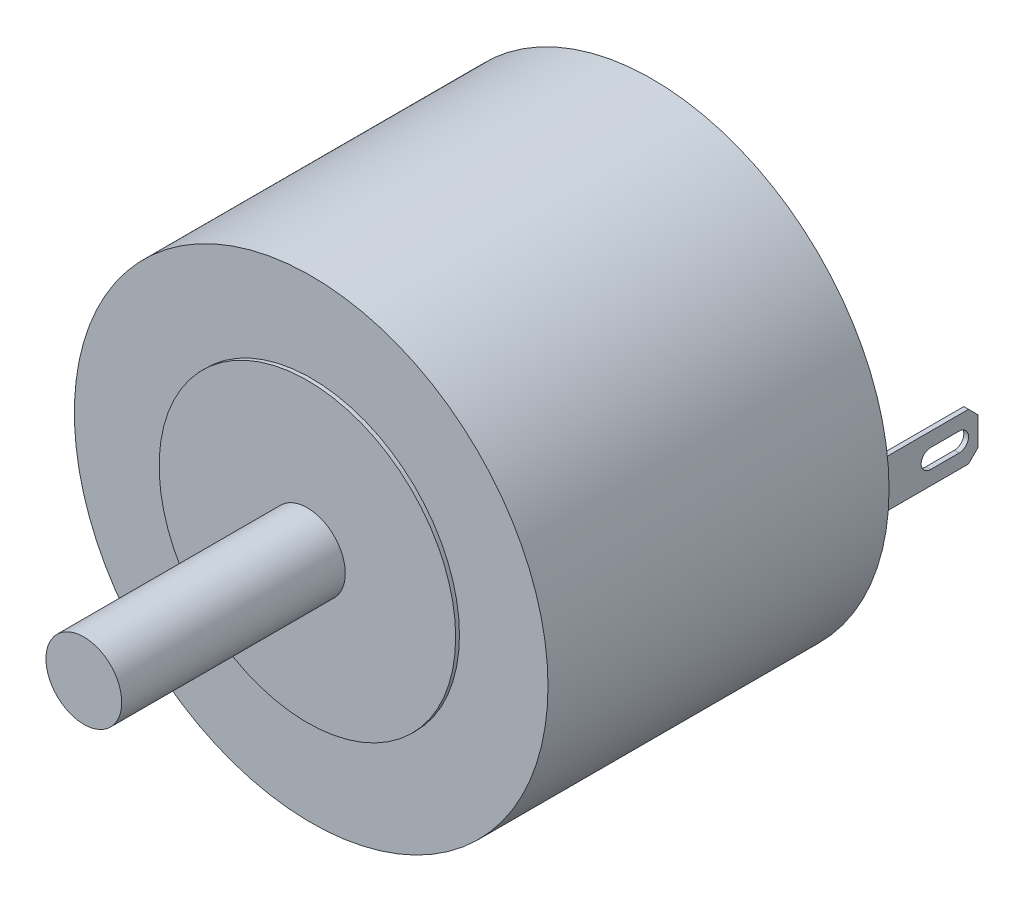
ISO-10303-21;
HEADER;
FILE_DESCRIPTION(('STEP AP214'),'2;1');
FILE_NAME('part.step','',(''),(''),'','','');
FILE_SCHEMA(('AUTOMOTIVE_DESIGN { 1 0 10303 214 1 1 1 1 }'));
ENDSEC;
DATA;
#1=APPLICATION_CONTEXT('core data for automotive mechanical design processes');
#2=APPLICATION_PROTOCOL_DEFINITION('international standard','automotive_design',2000,#1);
#3=PRODUCT_CONTEXT('',#1,'mechanical');
#4=PRODUCT('Part','Part','',(#3));
#5=PRODUCT_RELATED_PRODUCT_CATEGORY('part','',(#4));
#6=PRODUCT_DEFINITION_FORMATION('','',#4);
#7=PRODUCT_DEFINITION_CONTEXT('part definition',#1,'design');
#8=PRODUCT_DEFINITION('design','',#6,#7);
#9=PRODUCT_DEFINITION_SHAPE('','',#8);
#10=(LENGTH_UNIT() NAMED_UNIT(*) SI_UNIT(.MILLI.,.METRE.));
#11=(NAMED_UNIT(*) PLANE_ANGLE_UNIT() SI_UNIT($,.RADIAN.));
#12=(NAMED_UNIT(*) SI_UNIT($,.STERADIAN.) SOLID_ANGLE_UNIT());
#13=UNCERTAINTY_MEASURE_WITH_UNIT(LENGTH_MEASURE(1.E-05),#10,'distance_accuracy_value','');
#14=(GEOMETRIC_REPRESENTATION_CONTEXT(3) GLOBAL_UNCERTAINTY_ASSIGNED_CONTEXT((#13)) GLOBAL_UNIT_ASSIGNED_CONTEXT((#10,
#11,#12)) REPRESENTATION_CONTEXT('',''));
#15=CARTESIAN_POINT('',(0.,0.,0.));
#16=DIRECTION('',(0.,0.,1.));
#17=DIRECTION('',(1.,0.,0.));
#18=AXIS2_PLACEMENT_3D('',#15,#16,#17);
#19=CARTESIAN_POINT('',(-11.944768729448,-1.25000000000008,-23.));
#20=DIRECTION('',(0.,1.,0.));
#21=DIRECTION('',(-1.,0.,0.));
#22=AXIS2_PLACEMENT_3D('',#19,#20,#21);
#23=PLANE('',#22);
#24=DIRECTION('',(0.,0.,1.));
#25=VECTOR('',#24,1.);
#26=CARTESIAN_POINT('',(-12.194768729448,-1.25000000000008,-23.));
#27=LINE('',#26,#25);
#28=CARTESIAN_POINT('',(-12.194768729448,-1.25000000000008,-22.5));
#29=VERTEX_POINT('',#28);
#30=CARTESIAN_POINT('',(-12.194768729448,-1.25000000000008,-18.));
#31=VERTEX_POINT('',#30);
#32=EDGE_CURVE('E145',#29,#31,#27,.T.);
#33=ORIENTED_EDGE('',*,*,#32,.F.);
#34=DIRECTION('',(1.,0.,0.));
#35=VECTOR('',#34,1.);
#36=CARTESIAN_POINT('',(-11.944768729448,-1.25000000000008,-22.5));
#37=LINE('',#36,#35);
#38=CARTESIAN_POINT('',(-11.944768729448,-1.25000000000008,-22.5));
#39=VERTEX_POINT('',#38);
#40=EDGE_CURVE('E185',#29,#39,#37,.T.);
#41=ORIENTED_EDGE('',*,*,#40,.T.);
#42=DIRECTION('',(0.,0.,1.));
#43=VECTOR('',#42,1.);
#44=CARTESIAN_POINT('',(-11.944768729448,-1.25000000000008,-23.));
#45=LINE('',#44,#43);
#46=CARTESIAN_POINT('',(-11.944768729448,-1.25000000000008,-18.));
#47=VERTEX_POINT('',#46);
#48=EDGE_CURVE('E155',#39,#47,#45,.T.);
#49=ORIENTED_EDGE('',*,*,#48,.T.);
#50=DIRECTION('',(-1.,0.,0.));
#51=VECTOR('',#50,1.);
#52=CARTESIAN_POINT('',(-11.944768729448,-1.25000000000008,-18.));
#53=LINE('',#52,#51);
#54=EDGE_CURVE('E168',#47,#31,#53,.T.);
#55=ORIENTED_EDGE('',*,*,#54,.T.);
#56=EDGE_LOOP('',(#33,#41,#49,#55));
#57=FACE_BOUND('',#56,.T.);
#58=ADVANCED_FACE('F52',(#57),#23,.F.);
#59=CARTESIAN_POINT('',(-12.194768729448,-1.25000000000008,-23.));
#60=DIRECTION('',(1.,0.,0.));
#61=DIRECTION('',(0.,1.,0.));
#62=AXIS2_PLACEMENT_3D('',#59,#60,#61);
#63=PLANE('',#62);
#64=DIRECTION('',(0.,0.,1.));
#65=VECTOR('',#64,1.);
#66=CARTESIAN_POINT('',(-12.1947687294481,0.5,-23.));
#67=LINE('',#66,#65);
#68=CARTESIAN_POINT('',(-12.1947687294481,0.5,-22.));
#69=VERTEX_POINT('',#68);
#70=CARTESIAN_POINT('',(-12.1947687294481,0.5,-20.5));
#71=VERTEX_POINT('',#70);
#72=EDGE_CURVE('E144',#69,#71,#67,.T.);
#73=ORIENTED_EDGE('',*,*,#72,.T.);
#74=CARTESIAN_POINT('',(-12.1947687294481,0.,-20.5));
#75=DIRECTION('',(1.,0.,0.));
#76=DIRECTION('',(0.,1.,0.));
#77=AXIS2_PLACEMENT_3D('',#74,#75,#76);
#78=CIRCLE('',#77,0.5);
#79=CARTESIAN_POINT('',(-12.1947687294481,-0.5,-20.5));
#80=VERTEX_POINT('',#79);
#81=EDGE_CURVE('E136',#71,#80,#78,.T.);
#82=ORIENTED_EDGE('',*,*,#81,.T.);
#83=DIRECTION('',(0.,0.,-1.));
#84=VECTOR('',#83,1.);
#85=CARTESIAN_POINT('',(-12.1947687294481,-0.5,-23.));
#86=LINE('',#85,#84);
#87=CARTESIAN_POINT('',(-12.1947687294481,-0.5,-22.));
#88=VERTEX_POINT('',#87);
#89=EDGE_CURVE('E125',#80,#88,#86,.T.);
#90=ORIENTED_EDGE('',*,*,#89,.T.);
#91=CARTESIAN_POINT('',(-12.1947687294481,0.,-22.));
#92=DIRECTION('',(1.,0.,0.));
#93=DIRECTION('',(0.,1.,0.));
#94=AXIS2_PLACEMENT_3D('',#91,#92,#93);
#95=CIRCLE('',#94,0.5);
#96=EDGE_CURVE('E130',#88,#69,#95,.T.);
#97=ORIENTED_EDGE('',*,*,#96,.T.);
#98=EDGE_LOOP('',(#73,#82,#90,#97));
#99=FACE_BOUND('',#98,.T.);
#100=DIRECTION('',(0.,1.,0.));
#101=VECTOR('',#100,1.);
#102=CARTESIAN_POINT('',(-12.194768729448,-1.25000000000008,-23.));
#103=LINE('',#102,#101);
#104=CARTESIAN_POINT('',(-12.1947687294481,-0.750000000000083,-23.));
#105=VERTEX_POINT('',#104);
#106=CARTESIAN_POINT('',(-12.1947687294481,0.749999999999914,-23.));
#107=VERTEX_POINT('',#106);
#108=EDGE_CURVE('E162',#105,#107,#103,.T.);
#109=ORIENTED_EDGE('',*,*,#108,.F.);
#110=DIRECTION('',(0.,-0.707106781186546,0.707106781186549));
#111=VECTOR('',#110,1.);
#112=CARTESIAN_POINT('',(-12.1947687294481,-0.750000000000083,-23.));
#113=LINE('',#112,#111);
#114=EDGE_CURVE('E183',#105,#29,#113,.T.);
#115=ORIENTED_EDGE('',*,*,#114,.T.);
#116=ORIENTED_EDGE('',*,*,#32,.T.);
#117=DIRECTION('',(0.,1.,0.));
#118=VECTOR('',#117,1.);
#119=CARTESIAN_POINT('',(-12.194768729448,-1.25000000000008,-18.));
#120=LINE('',#119,#118);
#121=CARTESIAN_POINT('',(-12.1947687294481,1.24999999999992,-18.));
#122=VERTEX_POINT('',#121);
#123=EDGE_CURVE('E165',#31,#122,#120,.T.);
#124=ORIENTED_EDGE('',*,*,#123,.T.);
#125=DIRECTION('',(0.,0.,1.));
#126=VECTOR('',#125,1.);
#127=CARTESIAN_POINT('',(-12.1947687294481,1.24999999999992,-23.));
#128=LINE('',#127,#126);
#129=CARTESIAN_POINT('',(-12.1947687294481,1.24999999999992,-22.5));
#130=VERTEX_POINT('',#129);
#131=EDGE_CURVE('E147',#130,#122,#128,.T.);
#132=ORIENTED_EDGE('',*,*,#131,.F.);
#133=DIRECTION('',(0.,-0.707106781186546,-0.707106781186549));
#134=VECTOR('',#133,1.);
#135=CARTESIAN_POINT('',(-12.1947687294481,0.749999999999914,-23.));
#136=LINE('',#135,#134);
#137=EDGE_CURVE('E181',#130,#107,#136,.T.);
#138=ORIENTED_EDGE('',*,*,#137,.T.);
#139=EDGE_LOOP('',(#109,#115,#116,#124,#132,#138));
#140=FACE_BOUND('',#139,.T.);
#141=ADVANCED_FACE('F142',(#99,#140),#63,.F.);
#142=CARTESIAN_POINT('',(-12.1947687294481,1.24999999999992,-23.));
#143=DIRECTION('',(0.,-1.,0.));
#144=DIRECTION('',(1.,0.,0.));
#145=AXIS2_PLACEMENT_3D('',#142,#143,#144);
#146=PLANE('',#145);
#147=DIRECTION('',(0.,0.,1.));
#148=VECTOR('',#147,1.);
#149=CARTESIAN_POINT('',(-11.9447687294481,1.24999999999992,-23.));
#150=LINE('',#149,#148);
#151=CARTESIAN_POINT('',(-11.9447687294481,1.24999999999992,-22.5));
#152=VERTEX_POINT('',#151);
#153=CARTESIAN_POINT('',(-11.9447687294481,1.24999999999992,-18.));
#154=VERTEX_POINT('',#153);
#155=EDGE_CURVE('E153',#152,#154,#150,.T.);
#156=ORIENTED_EDGE('',*,*,#155,.F.);
#157=DIRECTION('',(-1.,0.,0.));
#158=VECTOR('',#157,1.);
#159=CARTESIAN_POINT('',(-12.1947687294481,1.24999999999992,-22.5));
#160=LINE('',#159,#158);
#161=EDGE_CURVE('E191',#152,#130,#160,.T.);
#162=ORIENTED_EDGE('',*,*,#161,.T.);
#163=ORIENTED_EDGE('',*,*,#131,.T.);
#164=DIRECTION('',(1.,0.,0.));
#165=VECTOR('',#164,1.);
#166=CARTESIAN_POINT('',(-12.1947687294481,1.24999999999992,-18.));
#167=LINE('',#166,#165);
#168=EDGE_CURVE('E161',#122,#154,#167,.T.);
#169=ORIENTED_EDGE('',*,*,#168,.T.);
#170=EDGE_LOOP('',(#156,#162,#163,#169));
#171=FACE_BOUND('',#170,.T.);
#172=ADVANCED_FACE('F225',(#171),#146,.F.);
#173=CARTESIAN_POINT('',(-11.944768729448,-1.25000000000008,-23.));
#174=DIRECTION('',(1.,0.,0.));
#175=DIRECTION('',(0.,1.,0.));
#176=AXIS2_PLACEMENT_3D('',#173,#174,#175);
#177=PLANE('',#176);
#178=CARTESIAN_POINT('',(-11.9447687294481,0.,-20.5));
#179=DIRECTION('',(1.,0.,0.));
#180=DIRECTION('',(0.,1.,0.));
#181=AXIS2_PLACEMENT_3D('',#178,#179,#180);
#182=CIRCLE('',#181,0.5);
#183=CARTESIAN_POINT('',(-11.9447687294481,0.5,-20.5));
#184=VERTEX_POINT('',#183);
#185=CARTESIAN_POINT('',(-11.9447687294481,-0.5,-20.5));
#186=VERTEX_POINT('',#185);
#187=EDGE_CURVE('E12',#184,#186,#182,.T.);
#188=ORIENTED_EDGE('',*,*,#187,.F.);
#189=DIRECTION('',(0.,0.,1.));
#190=VECTOR('',#189,1.);
#191=CARTESIAN_POINT('',(-11.9447687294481,0.5,-23.));
#192=LINE('',#191,#190);
#193=CARTESIAN_POINT('',(-11.9447687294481,0.5,-22.));
#194=VERTEX_POINT('',#193);
#195=EDGE_CURVE('E60',#194,#184,#192,.T.);
#196=ORIENTED_EDGE('',*,*,#195,.F.);
#197=CARTESIAN_POINT('',(-11.9447687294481,0.,-22.));
#198=DIRECTION('',(1.,0.,0.));
#199=DIRECTION('',(0.,1.,0.));
#200=AXIS2_PLACEMENT_3D('',#197,#198,#199);
#201=CIRCLE('',#200,0.5);
#202=CARTESIAN_POINT('',(-11.9447687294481,-0.5,-22.));
#203=VERTEX_POINT('',#202);
#204=EDGE_CURVE('E195',#203,#194,#201,.T.);
#205=ORIENTED_EDGE('',*,*,#204,.F.);
#206=DIRECTION('',(0.,0.,-1.));
#207=VECTOR('',#206,1.);
#208=CARTESIAN_POINT('',(-11.9447687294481,-0.5,-23.));
#209=LINE('',#208,#207);
#210=EDGE_CURVE('E193',#186,#203,#209,.T.);
#211=ORIENTED_EDGE('',*,*,#210,.F.);
#212=EDGE_LOOP('',(#188,#196,#205,#211));
#213=FACE_BOUND('',#212,.T.);
#214=ORIENTED_EDGE('',*,*,#48,.F.);
#215=DIRECTION('',(0.,0.707106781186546,-0.707106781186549));
#216=VECTOR('',#215,1.);
#217=CARTESIAN_POINT('',(-11.944768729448,-1.00000000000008,-22.75));
#218=LINE('',#217,#216);
#219=CARTESIAN_POINT('',(-11.9447687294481,-0.750000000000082,-23.));
#220=VERTEX_POINT('',#219);
#221=EDGE_CURVE('E189',#39,#220,#218,.T.);
#222=ORIENTED_EDGE('',*,*,#221,.T.);
#223=DIRECTION('',(0.,1.,0.));
#224=VECTOR('',#223,1.);
#225=CARTESIAN_POINT('',(-11.944768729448,-1.25000000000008,-23.));
#226=LINE('',#225,#224);
#227=CARTESIAN_POINT('',(-11.9447687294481,0.749999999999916,-23.));
#228=VERTEX_POINT('',#227);
#229=EDGE_CURVE('E157',#220,#228,#226,.T.);
#230=ORIENTED_EDGE('',*,*,#229,.T.);
#231=DIRECTION('',(0.,0.707106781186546,0.707106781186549));
#232=VECTOR('',#231,1.);
#233=CARTESIAN_POINT('',(-11.9447687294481,-0.250000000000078,-24.));
#234=LINE('',#233,#232);
#235=EDGE_CURVE('E187',#228,#152,#234,.T.);
#236=ORIENTED_EDGE('',*,*,#235,.T.);
#237=ORIENTED_EDGE('',*,*,#155,.T.);
#238=DIRECTION('',(0.,1.,0.));
#239=VECTOR('',#238,1.);
#240=CARTESIAN_POINT('',(-11.944768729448,-1.25000000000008,-18.));
#241=LINE('',#240,#239);
#242=EDGE_CURVE('E158',#47,#154,#241,.T.);
#243=ORIENTED_EDGE('',*,*,#242,.F.);
#244=EDGE_LOOP('',(#214,#222,#230,#236,#237,#243));
#245=FACE_BOUND('',#244,.T.);
#246=ADVANCED_FACE('F205',(#213,#245),#177,.T.);
#247=CARTESIAN_POINT('',(0.,0.,-23.));
#248=DIRECTION('',(0.,0.,-1.));
#249=DIRECTION('',(-1.,0.,0.));
#250=AXIS2_PLACEMENT_3D('',#247,#248,#249);
#251=PLANE('',#250);
#252=ORIENTED_EDGE('',*,*,#229,.F.);
#253=DIRECTION('',(-1.,0.,0.));
#254=VECTOR('',#253,1.);
#255=CARTESIAN_POINT('',(-12.1947687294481,-0.750000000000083,-23.));
#256=LINE('',#255,#254);
#257=EDGE_CURVE('E178',#220,#105,#256,.T.);
#258=ORIENTED_EDGE('',*,*,#257,.T.);
#259=ORIENTED_EDGE('',*,*,#108,.T.);
#260=DIRECTION('',(1.,0.,0.));
#261=VECTOR('',#260,1.);
#262=CARTESIAN_POINT('',(-11.9447687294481,0.749999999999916,-23.));
#263=LINE('',#262,#261);
#264=EDGE_CURVE('E171',#107,#228,#263,.T.);
#265=ORIENTED_EDGE('',*,*,#264,.T.);
#266=EDGE_LOOP('',(#252,#258,#259,#265));
#267=FACE_BOUND('',#266,.T.);
#268=ADVANCED_FACE('F235',(#267),#251,.T.);
#269=CARTESIAN_POINT('',(0.,0.,-18.));
#270=DIRECTION('',(0.,0.,-1.));
#271=DIRECTION('',(-1.,0.,0.));
#272=AXIS2_PLACEMENT_3D('',#269,#270,#271);
#273=PLANE('',#272);
#274=ORIENTED_EDGE('',*,*,#54,.F.);
#275=ORIENTED_EDGE('',*,*,#242,.T.);
#276=ORIENTED_EDGE('',*,*,#168,.F.);
#277=ORIENTED_EDGE('',*,*,#123,.F.);
#278=EDGE_LOOP('',(#274,#275,#276,#277));
#279=FACE_BOUND('',#278,.T.);
#280=ADVANCED_FACE('F236',(#279),#273,.F.);
#281=CARTESIAN_POINT('',(0.,-0.749999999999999,-23.));
#282=DIRECTION('',(0.,-0.707106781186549,-0.707106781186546));
#283=DIRECTION('',(1.,0.,0.));
#284=AXIS2_PLACEMENT_3D('',#281,#282,#283);
#285=PLANE('',#284);
#286=ORIENTED_EDGE('',*,*,#221,.F.);
#287=ORIENTED_EDGE('',*,*,#40,.F.);
#288=ORIENTED_EDGE('',*,*,#114,.F.);
#289=ORIENTED_EDGE('',*,*,#257,.F.);
#290=EDGE_LOOP('',(#286,#287,#288,#289));
#291=FACE_BOUND('',#290,.T.);
#292=ADVANCED_FACE('F239',(#291),#285,.T.);
#293=CARTESIAN_POINT('',(0.,0.749999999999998,-23.));
#294=DIRECTION('',(0.,0.707106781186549,-0.707106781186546));
#295=DIRECTION('',(-1.,0.,0.));
#296=AXIS2_PLACEMENT_3D('',#293,#294,#295);
#297=PLANE('',#296);
#298=ORIENTED_EDGE('',*,*,#137,.F.);
#299=ORIENTED_EDGE('',*,*,#161,.F.);
#300=ORIENTED_EDGE('',*,*,#235,.F.);
#301=ORIENTED_EDGE('',*,*,#264,.F.);
#302=EDGE_LOOP('',(#298,#299,#300,#301));
#303=FACE_BOUND('',#302,.T.);
#304=ADVANCED_FACE('F54',(#303),#297,.T.);
#305=CARTESIAN_POINT('',(-12.5,0.,-20.5));
#306=DIRECTION('',(1.,0.,0.));
#307=DIRECTION('',(0.,0.,-1.));
#308=AXIS2_PLACEMENT_3D('',#305,#306,#307);
#309=CYLINDRICAL_SURFACE('',#308,0.5);
#310=DIRECTION('',(1.,0.,0.));
#311=VECTOR('',#310,1.);
#312=CARTESIAN_POINT('',(-12.5,0.5,-20.5));
#313=LINE('',#312,#311);
#314=EDGE_CURVE('E131',#71,#184,#313,.T.);
#315=ORIENTED_EDGE('',*,*,#314,.T.);
#316=ORIENTED_EDGE('',*,*,#187,.T.);
#317=DIRECTION('',(1.,0.,0.));
#318=VECTOR('',#317,1.);
#319=CARTESIAN_POINT('',(-12.5,-0.5,-20.5));
#320=LINE('',#319,#318);
#321=EDGE_CURVE('E72',#80,#186,#320,.T.);
#322=ORIENTED_EDGE('',*,*,#321,.F.);
#323=ORIENTED_EDGE('',*,*,#81,.F.);
#324=EDGE_LOOP('',(#315,#316,#322,#323));
#325=FACE_BOUND('',#324,.T.);
#326=ADVANCED_FACE('F135',(#325),#309,.F.);
#327=CARTESIAN_POINT('',(-12.5,0.5,-20.5));
#328=DIRECTION('',(0.,1.,0.));
#329=DIRECTION('',(0.,0.,1.));
#330=AXIS2_PLACEMENT_3D('',#327,#328,#329);
#331=PLANE('',#330);
#332=DIRECTION('',(1.,0.,0.));
#333=VECTOR('',#332,1.);
#334=CARTESIAN_POINT('',(-12.5,0.5,-22.));
#335=LINE('',#334,#333);
#336=EDGE_CURVE('E201',#69,#194,#335,.T.);
#337=ORIENTED_EDGE('',*,*,#336,.T.);
#338=ORIENTED_EDGE('',*,*,#195,.T.);
#339=ORIENTED_EDGE('',*,*,#314,.F.);
#340=ORIENTED_EDGE('',*,*,#72,.F.);
#341=EDGE_LOOP('',(#337,#338,#339,#340));
#342=FACE_BOUND('',#341,.T.);
#343=ADVANCED_FACE('F199',(#342),#331,.F.);
#344=CARTESIAN_POINT('',(-12.5,0.,-22.));
#345=DIRECTION('',(1.,0.,0.));
#346=DIRECTION('',(0.,0.,-1.));
#347=AXIS2_PLACEMENT_3D('',#344,#345,#346);
#348=CYLINDRICAL_SURFACE('',#347,0.5);
#349=DIRECTION('',(1.,0.,0.));
#350=VECTOR('',#349,1.);
#351=CARTESIAN_POINT('',(-12.5,-0.5,-22.));
#352=LINE('',#351,#350);
#353=EDGE_CURVE('E67',#88,#203,#352,.T.);
#354=ORIENTED_EDGE('',*,*,#353,.T.);
#355=ORIENTED_EDGE('',*,*,#204,.T.);
#356=ORIENTED_EDGE('',*,*,#336,.F.);
#357=ORIENTED_EDGE('',*,*,#96,.F.);
#358=EDGE_LOOP('',(#354,#355,#356,#357));
#359=FACE_BOUND('',#358,.T.);
#360=ADVANCED_FACE('F208',(#359),#348,.F.);
#361=CARTESIAN_POINT('',(-12.5,-0.5,-20.5));
#362=DIRECTION('',(0.,-1.,0.));
#363=DIRECTION('',(0.,0.,-1.));
#364=AXIS2_PLACEMENT_3D('',#361,#362,#363);
#365=PLANE('',#364);
#366=ORIENTED_EDGE('',*,*,#321,.T.);
#367=ORIENTED_EDGE('',*,*,#210,.T.);
#368=ORIENTED_EDGE('',*,*,#353,.F.);
#369=ORIENTED_EDGE('',*,*,#89,.F.);
#370=EDGE_LOOP('',(#366,#367,#368,#369));
#371=FACE_BOUND('',#370,.T.);
#372=ADVANCED_FACE('F126',(#371),#365,.F.);
#373=CLOSED_SHELL('',(#58,#141,#172,#246,#268,#280,#292,#304,#326,#343,#360,#372));
#374=MANIFOLD_SOLID_BREP('B2',#373);
#375=CARTESIAN_POINT('',(11.9447687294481,1.25,-23.));
#376=DIRECTION('',(0.,-1.,0.));
#377=DIRECTION('',(0.,0.,-1.));
#378=AXIS2_PLACEMENT_3D('',#375,#376,#377);
#379=PLANE('',#378);
#380=DIRECTION('',(0.,0.,1.));
#381=VECTOR('',#380,1.);
#382=CARTESIAN_POINT('',(12.1947687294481,1.25,-23.));
#383=LINE('',#382,#381);
#384=CARTESIAN_POINT('',(12.1947687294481,1.25,-22.5));
#385=VERTEX_POINT('',#384);
#386=CARTESIAN_POINT('',(12.1947687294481,1.25,-18.));
#387=VERTEX_POINT('',#386);
#388=EDGE_CURVE('E469',#385,#387,#383,.T.);
#389=ORIENTED_EDGE('',*,*,#388,.F.);
#390=DIRECTION('',(-1.,0.,0.));
#391=VECTOR('',#390,1.);
#392=CARTESIAN_POINT('',(11.9447687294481,1.25,-22.5));
#393=LINE('',#392,#391);
#394=CARTESIAN_POINT('',(11.9447687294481,1.25,-22.5));
#395=VERTEX_POINT('',#394);
#396=EDGE_CURVE('E487',#385,#395,#393,.T.);
#397=ORIENTED_EDGE('',*,*,#396,.T.);
#398=DIRECTION('',(0.,0.,1.));
#399=VECTOR('',#398,1.);
#400=CARTESIAN_POINT('',(11.9447687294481,1.25,-23.));
#401=LINE('',#400,#399);
#402=CARTESIAN_POINT('',(11.9447687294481,1.25,-18.));
#403=VERTEX_POINT('',#402);
#404=EDGE_CURVE('E453',#395,#403,#401,.T.);
#405=ORIENTED_EDGE('',*,*,#404,.T.);
#406=DIRECTION('',(1.,0.,0.));
#407=VECTOR('',#406,1.);
#408=CARTESIAN_POINT('',(11.9447687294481,1.25,-18.));
#409=LINE('',#408,#407);
#410=EDGE_CURVE('E443',#403,#387,#409,.T.);
#411=ORIENTED_EDGE('',*,*,#410,.T.);
#412=EDGE_LOOP('',(#389,#397,#405,#411));
#413=FACE_BOUND('',#412,.T.);
#414=ADVANCED_FACE('F341',(#413),#379,.F.);
#415=CARTESIAN_POINT('',(12.1947687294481,1.25,-23.));
#416=DIRECTION('',(-1.,0.,0.));
#417=DIRECTION('',(0.,0.,1.));
#418=AXIS2_PLACEMENT_3D('',#415,#416,#417);
#419=PLANE('',#418);
#420=DIRECTION('',(0.,0.,-1.));
#421=VECTOR('',#420,1.);
#422=CARTESIAN_POINT('',(12.1947687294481,-0.5,-20.5));
#423=LINE('',#422,#421);
#424=CARTESIAN_POINT('',(12.1947687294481,-0.5,-20.5));
#425=VERTEX_POINT('',#424);
#426=CARTESIAN_POINT('',(12.1947687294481,-0.5,-22.));
#427=VERTEX_POINT('',#426);
#428=EDGE_CURVE('E429',#425,#427,#423,.T.);
#429=ORIENTED_EDGE('',*,*,#428,.F.);
#430=CARTESIAN_POINT('',(12.1947687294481,0.,-20.5));
#431=DIRECTION('',(1.,0.,0.));
#432=DIRECTION('',(0.,0.,-1.));
#433=AXIS2_PLACEMENT_3D('',#430,#431,#432);
#434=CIRCLE('',#433,0.5);
#435=CARTESIAN_POINT('',(12.1947687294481,0.5,-20.5));
#436=VERTEX_POINT('',#435);
#437=EDGE_CURVE('E356',#436,#425,#434,.T.);
#438=ORIENTED_EDGE('',*,*,#437,.F.);
#439=DIRECTION('',(0.,0.,1.));
#440=VECTOR('',#439,1.);
#441=CARTESIAN_POINT('',(12.1947687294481,0.5,-20.5));
#442=LINE('',#441,#440);
#443=CARTESIAN_POINT('',(12.1947687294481,0.5,-22.));
#444=VERTEX_POINT('',#443);
#445=EDGE_CURVE('E436',#444,#436,#442,.T.);
#446=ORIENTED_EDGE('',*,*,#445,.F.);
#447=CARTESIAN_POINT('',(12.1947687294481,0.,-22.));
#448=DIRECTION('',(1.,0.,0.));
#449=DIRECTION('',(0.,0.,-1.));
#450=AXIS2_PLACEMENT_3D('',#447,#448,#449);
#451=CIRCLE('',#450,0.5);
#452=EDGE_CURVE('E420',#427,#444,#451,.T.);
#453=ORIENTED_EDGE('',*,*,#452,.F.);
#454=EDGE_LOOP('',(#429,#438,#446,#453));
#455=FACE_BOUND('',#454,.T.);
#456=DIRECTION('',(0.,0.,1.));
#457=VECTOR('',#456,1.);
#458=CARTESIAN_POINT('',(12.1947687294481,-1.25,-23.));
#459=LINE('',#458,#457);
#460=CARTESIAN_POINT('',(12.1947687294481,-1.25,-22.5));
#461=VERTEX_POINT('',#460);
#462=CARTESIAN_POINT('',(12.1947687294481,-1.25,-18.));
#463=VERTEX_POINT('',#462);
#464=EDGE_CURVE('E467',#461,#463,#459,.T.);
#465=ORIENTED_EDGE('',*,*,#464,.F.);
#466=DIRECTION('',(0.,0.707106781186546,-0.707106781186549));
#467=VECTOR('',#466,1.);
#468=CARTESIAN_POINT('',(12.1947687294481,-0.750000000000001,-23.));
#469=LINE('',#468,#467);
#470=CARTESIAN_POINT('',(12.1947687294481,-0.750000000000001,-23.));
#471=VERTEX_POINT('',#470);
#472=EDGE_CURVE('E485',#461,#471,#469,.T.);
#473=ORIENTED_EDGE('',*,*,#472,.T.);
#474=DIRECTION('',(0.,-1.,0.));
#475=VECTOR('',#474,1.);
#476=CARTESIAN_POINT('',(12.1947687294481,1.25,-23.));
#477=LINE('',#476,#475);
#478=CARTESIAN_POINT('',(12.1947687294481,0.750000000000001,-23.));
#479=VERTEX_POINT('',#478);
#480=EDGE_CURVE('E446',#479,#471,#477,.T.);
#481=ORIENTED_EDGE('',*,*,#480,.F.);
#482=DIRECTION('',(0.,0.707106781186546,0.707106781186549));
#483=VECTOR('',#482,1.);
#484=CARTESIAN_POINT('',(12.1947687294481,0.750000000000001,-23.));
#485=LINE('',#484,#483);
#486=EDGE_CURVE('E483',#479,#385,#485,.T.);
#487=ORIENTED_EDGE('',*,*,#486,.T.);
#488=ORIENTED_EDGE('',*,*,#388,.T.);
#489=DIRECTION('',(0.,-1.,0.));
#490=VECTOR('',#489,1.);
#491=CARTESIAN_POINT('',(12.1947687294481,1.25,-18.));
#492=LINE('',#491,#490);
#493=EDGE_CURVE('E456',#387,#463,#492,.T.);
#494=ORIENTED_EDGE('',*,*,#493,.T.);
#495=EDGE_LOOP('',(#465,#473,#481,#487,#488,#494));
#496=FACE_BOUND('',#495,.T.);
#497=ADVANCED_FACE('F433',(#455,#496),#419,.F.);
#498=CARTESIAN_POINT('',(12.1947687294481,-1.25,-23.));
#499=DIRECTION('',(0.,1.,0.));
#500=DIRECTION('',(0.,0.,1.));
#501=AXIS2_PLACEMENT_3D('',#498,#499,#500);
#502=PLANE('',#501);
#503=DIRECTION('',(0.,0.,1.));
#504=VECTOR('',#503,1.);
#505=CARTESIAN_POINT('',(11.9447687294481,-1.25,-23.));
#506=LINE('',#505,#504);
#507=CARTESIAN_POINT('',(11.9447687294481,-1.25,-22.5));
#508=VERTEX_POINT('',#507);
#509=CARTESIAN_POINT('',(11.9447687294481,-1.25,-18.));
#510=VERTEX_POINT('',#509);
#511=EDGE_CURVE('E465',#508,#510,#506,.T.);
#512=ORIENTED_EDGE('',*,*,#511,.F.);
#513=DIRECTION('',(1.,0.,0.));
#514=VECTOR('',#513,1.);
#515=CARTESIAN_POINT('',(12.1947687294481,-1.25,-22.5));
#516=LINE('',#515,#514);
#517=EDGE_CURVE('E481',#508,#461,#516,.T.);
#518=ORIENTED_EDGE('',*,*,#517,.T.);
#519=ORIENTED_EDGE('',*,*,#464,.T.);
#520=DIRECTION('',(-1.,0.,0.));
#521=VECTOR('',#520,1.);
#522=CARTESIAN_POINT('',(12.1947687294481,-1.25,-18.));
#523=LINE('',#522,#521);
#524=EDGE_CURVE('E459',#463,#510,#523,.T.);
#525=ORIENTED_EDGE('',*,*,#524,.T.);
#526=EDGE_LOOP('',(#512,#518,#519,#525));
#527=FACE_BOUND('',#526,.T.);
#528=ADVANCED_FACE('F517',(#527),#502,.F.);
#529=CARTESIAN_POINT('',(11.9447687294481,1.25,-23.));
#530=DIRECTION('',(-1.,0.,0.));
#531=DIRECTION('',(0.,0.,1.));
#532=AXIS2_PLACEMENT_3D('',#529,#530,#531);
#533=PLANE('',#532);
#534=CARTESIAN_POINT('',(11.9447687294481,0.,-20.5));
#535=DIRECTION('',(-1.,0.,0.));
#536=DIRECTION('',(0.,0.,1.));
#537=AXIS2_PLACEMENT_3D('',#534,#535,#536);
#538=CIRCLE('',#537,0.5);
#539=CARTESIAN_POINT('',(11.9447687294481,-0.5,-20.5));
#540=VERTEX_POINT('',#539);
#541=CARTESIAN_POINT('',(11.9447687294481,0.5,-20.5));
#542=VERTEX_POINT('',#541);
#543=EDGE_CURVE('E50',#540,#542,#538,.T.);
#544=ORIENTED_EDGE('',*,*,#543,.F.);
#545=DIRECTION('',(0.,0.,1.));
#546=VECTOR('',#545,1.);
#547=CARTESIAN_POINT('',(11.9447687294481,-0.5,-23.));
#548=LINE('',#547,#546);
#549=CARTESIAN_POINT('',(11.9447687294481,-0.5,-22.));
#550=VERTEX_POINT('',#549);
#551=EDGE_CURVE('E489',#550,#540,#548,.T.);
#552=ORIENTED_EDGE('',*,*,#551,.F.);
#553=CARTESIAN_POINT('',(11.9447687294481,0.,-22.));
#554=DIRECTION('',(-1.,0.,0.));
#555=DIRECTION('',(0.,0.,1.));
#556=AXIS2_PLACEMENT_3D('',#553,#554,#555);
#557=CIRCLE('',#556,0.5);
#558=CARTESIAN_POINT('',(11.9447687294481,0.5,-22.));
#559=VERTEX_POINT('',#558);
#560=EDGE_CURVE('E423',#559,#550,#557,.T.);
#561=ORIENTED_EDGE('',*,*,#560,.F.);
#562=DIRECTION('',(0.,0.,-1.));
#563=VECTOR('',#562,1.);
#564=CARTESIAN_POINT('',(11.9447687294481,0.5,-23.));
#565=LINE('',#564,#563);
#566=EDGE_CURVE('E349',#542,#559,#565,.T.);
#567=ORIENTED_EDGE('',*,*,#566,.F.);
#568=EDGE_LOOP('',(#544,#552,#561,#567));
#569=FACE_BOUND('',#568,.T.);
#570=DIRECTION('',(0.,-1.,0.));
#571=VECTOR('',#570,1.);
#572=CARTESIAN_POINT('',(11.9447687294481,1.25,-23.));
#573=LINE('',#572,#571);
#574=CARTESIAN_POINT('',(11.9447687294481,0.750000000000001,-23.));
#575=VERTEX_POINT('',#574);
#576=CARTESIAN_POINT('',(11.9447687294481,-0.750000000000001,-23.));
#577=VERTEX_POINT('',#576);
#578=EDGE_CURVE('E449',#575,#577,#573,.T.);
#579=ORIENTED_EDGE('',*,*,#578,.T.);
#580=DIRECTION('',(0.,-0.707106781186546,0.707106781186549));
#581=VECTOR('',#580,1.);
#582=CARTESIAN_POINT('',(11.9447687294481,0.249999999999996,-24.));
#583=LINE('',#582,#581);
#584=EDGE_CURVE('E479',#577,#508,#583,.T.);
#585=ORIENTED_EDGE('',*,*,#584,.T.);
#586=ORIENTED_EDGE('',*,*,#511,.T.);
#587=DIRECTION('',(0.,-1.,0.));
#588=VECTOR('',#587,1.);
#589=CARTESIAN_POINT('',(11.9447687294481,1.25,-18.));
#590=LINE('',#589,#588);
#591=EDGE_CURVE('E450',#403,#510,#590,.T.);
#592=ORIENTED_EDGE('',*,*,#591,.F.);
#593=ORIENTED_EDGE('',*,*,#404,.F.);
#594=DIRECTION('',(0.,-0.707106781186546,-0.707106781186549));
#595=VECTOR('',#594,1.);
#596=CARTESIAN_POINT('',(11.9447687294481,1.,-22.75));
#597=LINE('',#596,#595);
#598=EDGE_CURVE('E477',#395,#575,#597,.T.);
#599=ORIENTED_EDGE('',*,*,#598,.T.);
#600=EDGE_LOOP('',(#579,#585,#586,#592,#593,#599));
#601=FACE_BOUND('',#600,.T.);
#602=ADVANCED_FACE('F497',(#569,#601),#533,.T.);
#603=CARTESIAN_POINT('',(0.,0.,-23.));
#604=DIRECTION('',(0.,0.,-1.));
#605=DIRECTION('',(-1.,0.,0.));
#606=AXIS2_PLACEMENT_3D('',#603,#604,#605);
#607=PLANE('',#606);
#608=ORIENTED_EDGE('',*,*,#480,.T.);
#609=DIRECTION('',(-1.,0.,0.));
#610=VECTOR('',#609,1.);
#611=CARTESIAN_POINT('',(11.9447687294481,-0.750000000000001,-23.));
#612=LINE('',#611,#610);
#613=EDGE_CURVE('E474',#471,#577,#612,.T.);
#614=ORIENTED_EDGE('',*,*,#613,.T.);
#615=ORIENTED_EDGE('',*,*,#578,.F.);
#616=DIRECTION('',(1.,0.,0.));
#617=VECTOR('',#616,1.);
#618=CARTESIAN_POINT('',(12.1947687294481,0.750000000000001,-23.));
#619=LINE('',#618,#617);
#620=EDGE_CURVE('E471',#575,#479,#619,.T.);
#621=ORIENTED_EDGE('',*,*,#620,.T.);
#622=EDGE_LOOP('',(#608,#614,#615,#621));
#623=FACE_BOUND('',#622,.T.);
#624=ADVANCED_FACE('F527',(#623),#607,.T.);
#625=CARTESIAN_POINT('',(0.,0.,-18.));
#626=DIRECTION('',(0.,0.,-1.));
#627=DIRECTION('',(-1.,0.,0.));
#628=AXIS2_PLACEMENT_3D('',#625,#626,#627);
#629=PLANE('',#628);
#630=ORIENTED_EDGE('',*,*,#410,.F.);
#631=ORIENTED_EDGE('',*,*,#591,.T.);
#632=ORIENTED_EDGE('',*,*,#524,.F.);
#633=ORIENTED_EDGE('',*,*,#493,.F.);
#634=EDGE_LOOP('',(#630,#631,#632,#633));
#635=FACE_BOUND('',#634,.T.);
#636=ADVANCED_FACE('F522',(#635),#629,.F.);
#637=CARTESIAN_POINT('',(0.,-0.750000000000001,-23.));
#638=DIRECTION('',(0.,-0.707106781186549,-0.707106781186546));
#639=DIRECTION('',(1.,0.,0.));
#640=AXIS2_PLACEMENT_3D('',#637,#638,#639);
#641=PLANE('',#640);
#642=ORIENTED_EDGE('',*,*,#472,.F.);
#643=ORIENTED_EDGE('',*,*,#517,.F.);
#644=ORIENTED_EDGE('',*,*,#584,.F.);
#645=ORIENTED_EDGE('',*,*,#613,.F.);
#646=EDGE_LOOP('',(#642,#643,#644,#645));
#647=FACE_BOUND('',#646,.T.);
#648=ADVANCED_FACE('F507',(#647),#641,.T.);
#649=CARTESIAN_POINT('',(0.,0.750000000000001,-23.));
#650=DIRECTION('',(0.,0.707106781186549,-0.707106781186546));
#651=DIRECTION('',(-1.,0.,0.));
#652=AXIS2_PLACEMENT_3D('',#649,#650,#651);
#653=PLANE('',#652);
#654=ORIENTED_EDGE('',*,*,#598,.F.);
#655=ORIENTED_EDGE('',*,*,#396,.F.);
#656=ORIENTED_EDGE('',*,*,#486,.F.);
#657=ORIENTED_EDGE('',*,*,#620,.F.);
#658=EDGE_LOOP('',(#654,#655,#656,#657));
#659=FACE_BOUND('',#658,.T.);
#660=ADVANCED_FACE('F343',(#659),#653,.T.);
#661=CARTESIAN_POINT('',(-12.5,0.,-20.5));
#662=DIRECTION('',(1.,0.,0.));
#663=DIRECTION('',(0.,0.,-1.));
#664=AXIS2_PLACEMENT_3D('',#661,#662,#663);
#665=CYLINDRICAL_SURFACE('',#664,0.5);
#666=ORIENTED_EDGE('',*,*,#543,.T.);
#667=DIRECTION('',(1.,0.,0.));
#668=VECTOR('',#667,1.);
#669=CARTESIAN_POINT('',(-12.5,0.5,-20.5));
#670=LINE('',#669,#668);
#671=EDGE_CURVE('E441',#542,#436,#670,.T.);
#672=ORIENTED_EDGE('',*,*,#671,.T.);
#673=ORIENTED_EDGE('',*,*,#437,.T.);
#674=DIRECTION('',(1.,0.,0.));
#675=VECTOR('',#674,1.);
#676=CARTESIAN_POINT('',(-12.5,-0.5,-20.5));
#677=LINE('',#676,#675);
#678=EDGE_CURVE('E426',#540,#425,#677,.T.);
#679=ORIENTED_EDGE('',*,*,#678,.F.);
#680=EDGE_LOOP('',(#666,#672,#673,#679));
#681=FACE_BOUND('',#680,.T.);
#682=ADVANCED_FACE('F499',(#681),#665,.F.);
#683=CARTESIAN_POINT('',(-12.5,0.5,-20.5));
#684=DIRECTION('',(0.,1.,0.));
#685=DIRECTION('',(0.,0.,1.));
#686=AXIS2_PLACEMENT_3D('',#683,#684,#685);
#687=PLANE('',#686);
#688=ORIENTED_EDGE('',*,*,#566,.T.);
#689=DIRECTION('',(1.,0.,0.));
#690=VECTOR('',#689,1.);
#691=CARTESIAN_POINT('',(-12.5,0.5,-22.));
#692=LINE('',#691,#690);
#693=EDGE_CURVE('E425',#559,#444,#692,.T.);
#694=ORIENTED_EDGE('',*,*,#693,.T.);
#695=ORIENTED_EDGE('',*,*,#445,.T.);
#696=ORIENTED_EDGE('',*,*,#671,.F.);
#697=EDGE_LOOP('',(#688,#694,#695,#696));
#698=FACE_BOUND('',#697,.T.);
#699=ADVANCED_FACE('F494',(#698),#687,.F.);
#700=CARTESIAN_POINT('',(-12.5,0.,-22.));
#701=DIRECTION('',(1.,0.,0.));
#702=DIRECTION('',(0.,0.,-1.));
#703=AXIS2_PLACEMENT_3D('',#700,#701,#702);
#704=CYLINDRICAL_SURFACE('',#703,0.5);
#705=ORIENTED_EDGE('',*,*,#560,.T.);
#706=DIRECTION('',(1.,0.,0.));
#707=VECTOR('',#706,1.);
#708=CARTESIAN_POINT('',(-12.5,-0.5,-22.));
#709=LINE('',#708,#707);
#710=EDGE_CURVE('E364',#550,#427,#709,.T.);
#711=ORIENTED_EDGE('',*,*,#710,.T.);
#712=ORIENTED_EDGE('',*,*,#452,.T.);
#713=ORIENTED_EDGE('',*,*,#693,.F.);
#714=EDGE_LOOP('',(#705,#711,#712,#713));
#715=FACE_BOUND('',#714,.T.);
#716=ADVANCED_FACE('F417',(#715),#704,.F.);
#717=CARTESIAN_POINT('',(-12.5,-0.5,-20.5));
#718=DIRECTION('',(0.,-1.,0.));
#719=DIRECTION('',(0.,0.,-1.));
#720=AXIS2_PLACEMENT_3D('',#717,#718,#719);
#721=PLANE('',#720);
#722=ORIENTED_EDGE('',*,*,#551,.T.);
#723=ORIENTED_EDGE('',*,*,#678,.T.);
#724=ORIENTED_EDGE('',*,*,#428,.T.);
#725=ORIENTED_EDGE('',*,*,#710,.F.);
#726=EDGE_LOOP('',(#722,#723,#724,#725));
#727=FACE_BOUND('',#726,.T.);
#728=ADVANCED_FACE('F430',(#727),#721,.F.);
#729=CLOSED_SHELL('',(#414,#497,#528,#602,#624,#636,#648,#660,#682,#699,#716,#728));
#730=MANIFOLD_SOLID_BREP('B6',#729);
#731=CARTESIAN_POINT('',(0.,0.,-18.));
#732=DIRECTION('',(0.,0.,1.));
#733=DIRECTION('',(1.,0.,0.));
#734=AXIS2_PLACEMENT_3D('',#731,#732,#733);
#735=CYLINDRICAL_SURFACE('',#734,12.5);
#736=CARTESIAN_POINT('',(0.,0.,-18.));
#737=DIRECTION('',(0.,0.,1.));
#738=DIRECTION('',(1.,0.,0.));
#739=AXIS2_PLACEMENT_3D('',#736,#737,#738);
#740=CIRCLE('',#739,12.5);
#741=CARTESIAN_POINT('',(12.5,0.,-18.));
#742=VERTEX_POINT('',#741);
#743=EDGE_CURVE('E630',#742,#742,#740,.T.);
#744=ORIENTED_EDGE('',*,*,#743,.T.);
#745=EDGE_LOOP('',(#744));
#746=FACE_BOUND('',#745,.T.);
#747=CARTESIAN_POINT('',(0.,0.,0.));
#748=DIRECTION('',(0.,0.,1.));
#749=DIRECTION('',(1.,0.,0.));
#750=AXIS2_PLACEMENT_3D('',#747,#748,#749);
#751=CIRCLE('',#750,12.5);
#752=CARTESIAN_POINT('',(12.5,0.,0.));
#753=VERTEX_POINT('',#752);
#754=EDGE_CURVE('E635',#753,#753,#751,.T.);
#755=ORIENTED_EDGE('',*,*,#754,.F.);
#756=EDGE_LOOP('',(#755));
#757=FACE_BOUND('',#756,.T.);
#758=ADVANCED_FACE('F623',(#746,#757),#735,.T.);
#759=CARTESIAN_POINT('',(0.,0.,-18.));
#760=DIRECTION('',(0.,0.,1.));
#761=DIRECTION('',(1.,0.,0.));
#762=AXIS2_PLACEMENT_3D('',#759,#760,#761);
#763=PLANE('',#762);
#764=CARTESIAN_POINT('',(0.,0.,-18.));
#765=DIRECTION('',(0.,0.,-1.));
#766=DIRECTION('',(-1.,0.,0.));
#767=AXIS2_PLACEMENT_3D('',#764,#765,#766);
#768=CIRCLE('',#767,11.);
#769=CARTESIAN_POINT('',(-11.,0.,-18.));
#770=VERTEX_POINT('',#769);
#771=EDGE_CURVE('E659',#770,#770,#768,.T.);
#772=ORIENTED_EDGE('',*,*,#771,.F.);
#773=EDGE_LOOP('',(#772));
#774=FACE_BOUND('',#773,.T.);
#775=ORIENTED_EDGE('',*,*,#743,.F.);
#776=EDGE_LOOP('',(#775));
#777=FACE_BOUND('',#776,.T.);
#778=ADVANCED_FACE('F695',(#774,#777),#763,.F.);
#779=CARTESIAN_POINT('',(0.,0.,0.));
#780=DIRECTION('',(0.,0.,1.));
#781=DIRECTION('',(1.,0.,0.));
#782=AXIS2_PLACEMENT_3D('',#779,#780,#781);
#783=PLANE('',#782);
#784=CARTESIAN_POINT('',(0.,0.,0.));
#785=DIRECTION('',(0.,0.,1.));
#786=DIRECTION('',(1.,0.,0.));
#787=AXIS2_PLACEMENT_3D('',#784,#785,#786);
#788=CIRCLE('',#787,7.82608695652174);
#789=CARTESIAN_POINT('',(7.82608695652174,0.,0.));
#790=VERTEX_POINT('',#789);
#791=EDGE_CURVE('E647',#790,#790,#788,.T.);
#792=ORIENTED_EDGE('',*,*,#791,.F.);
#793=EDGE_LOOP('',(#792));
#794=FACE_BOUND('',#793,.T.);
#795=ORIENTED_EDGE('',*,*,#754,.T.);
#796=EDGE_LOOP('',(#795));
#797=FACE_BOUND('',#796,.T.);
#798=ADVANCED_FACE('F699',(#794,#797),#783,.T.);
#799=CARTESIAN_POINT('',(0.,0.,0.2));
#800=DIRECTION('',(0.,0.,-1.));
#801=DIRECTION('',(-1.,0.,0.));
#802=AXIS2_PLACEMENT_3D('',#799,#800,#801);
#803=CYLINDRICAL_SURFACE('',#802,7.82608695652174);
#804=CARTESIAN_POINT('',(0.,0.,0.2));
#805=DIRECTION('',(0.,0.,1.));
#806=DIRECTION('',(1.,0.,0.));
#807=AXIS2_PLACEMENT_3D('',#804,#805,#806);
#808=CIRCLE('',#807,7.82608695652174);
#809=CARTESIAN_POINT('',(7.82608695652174,0.,0.2));
#810=VERTEX_POINT('',#809);
#811=EDGE_CURVE('E646',#810,#810,#808,.T.);
#812=ORIENTED_EDGE('',*,*,#811,.F.);
#813=EDGE_LOOP('',(#812));
#814=FACE_BOUND('',#813,.T.);
#815=ORIENTED_EDGE('',*,*,#791,.T.);
#816=EDGE_LOOP('',(#815));
#817=FACE_BOUND('',#816,.T.);
#818=ADVANCED_FACE('F706',(#814,#817),#803,.T.);
#819=CARTESIAN_POINT('',(0.,0.,0.2));
#820=DIRECTION('',(0.,0.,1.));
#821=DIRECTION('',(1.,0.,0.));
#822=AXIS2_PLACEMENT_3D('',#819,#820,#821);
#823=PLANE('',#822);
#824=CARTESIAN_POINT('',(0.,0.,0.2));
#825=DIRECTION('',(0.,0.,1.));
#826=DIRECTION('',(1.,0.,0.));
#827=AXIS2_PLACEMENT_3D('',#824,#825,#826);
#828=CIRCLE('',#827,2.);
#829=CARTESIAN_POINT('',(2.,0.,0.2));
#830=VERTEX_POINT('',#829);
#831=EDGE_CURVE('E641',#830,#830,#828,.T.);
#832=ORIENTED_EDGE('',*,*,#831,.F.);
#833=EDGE_LOOP('',(#832));
#834=FACE_BOUND('',#833,.T.);
#835=ORIENTED_EDGE('',*,*,#811,.T.);
#836=EDGE_LOOP('',(#835));
#837=FACE_BOUND('',#836,.T.);
#838=ADVANCED_FACE('F711',(#834,#837),#823,.T.);
#839=CARTESIAN_POINT('',(0.,0.,-17.));
#840=DIRECTION('',(0.,0.,-1.));
#841=DIRECTION('',(-1.,0.,0.));
#842=AXIS2_PLACEMENT_3D('',#839,#840,#841);
#843=CYLINDRICAL_SURFACE('',#842,11.);
#844=CARTESIAN_POINT('',(0.,0.,-17.));
#845=DIRECTION('',(0.,0.,-1.));
#846=DIRECTION('',(-1.,0.,0.));
#847=AXIS2_PLACEMENT_3D('',#844,#845,#846);
#848=CIRCLE('',#847,11.);
#849=CARTESIAN_POINT('',(-11.,0.,-17.));
#850=VERTEX_POINT('',#849);
#851=EDGE_CURVE('E658',#850,#850,#848,.T.);
#852=ORIENTED_EDGE('',*,*,#851,.F.);
#853=EDGE_LOOP('',(#852));
#854=FACE_BOUND('',#853,.T.);
#855=ORIENTED_EDGE('',*,*,#771,.T.);
#856=EDGE_LOOP('',(#855));
#857=FACE_BOUND('',#856,.T.);
#858=ADVANCED_FACE('F717',(#854,#857),#843,.F.);
#859=CARTESIAN_POINT('',(0.,0.,-17.));
#860=DIRECTION('',(0.,0.,-1.));
#861=DIRECTION('',(-1.,0.,0.));
#862=AXIS2_PLACEMENT_3D('',#859,#860,#861);
#863=PLANE('',#862);
#864=CARTESIAN_POINT('',(0.,0.,-17.));
#865=DIRECTION('',(0.,0.,-1.));
#866=DIRECTION('',(-1.,0.,0.));
#867=AXIS2_PLACEMENT_3D('',#864,#865,#866);
#868=CIRCLE('',#867,4.5);
#869=CARTESIAN_POINT('',(-4.5,0.,-17.));
#870=VERTEX_POINT('',#869);
#871=EDGE_CURVE('E663',#870,#870,#868,.F.);
#872=ORIENTED_EDGE('',*,*,#871,.T.);
#873=EDGE_LOOP('',(#872));
#874=FACE_BOUND('',#873,.T.);
#875=ORIENTED_EDGE('',*,*,#851,.T.);
#876=EDGE_LOOP('',(#875));
#877=FACE_BOUND('',#876,.T.);
#878=ADVANCED_FACE('F727',(#874,#877),#863,.T.);
#879=CARTESIAN_POINT('',(0.,0.,-19.5));
#880=DIRECTION('',(0.,0.,-1.));
#881=DIRECTION('',(-1.,0.,0.));
#882=AXIS2_PLACEMENT_3D('',#879,#880,#881);
#883=PLANE('',#882);
#884=CARTESIAN_POINT('',(0.,0.,-19.5));
#885=DIRECTION('',(0.,0.,-1.));
#886=DIRECTION('',(-1.,0.,0.));
#887=AXIS2_PLACEMENT_3D('',#884,#885,#886);
#888=CIRCLE('',#887,2.);
#889=CARTESIAN_POINT('',(-2.,0.,-19.5));
#890=VERTEX_POINT('',#889);
#891=EDGE_CURVE('E340',#890,#890,#888,.T.);
#892=ORIENTED_EDGE('',*,*,#891,.F.);
#893=EDGE_LOOP('',(#892));
#894=FACE_BOUND('',#893,.T.);
#895=CARTESIAN_POINT('',(0.,0.,-19.5));
#896=DIRECTION('',(0.,0.,-1.));
#897=DIRECTION('',(-1.,0.,0.));
#898=AXIS2_PLACEMENT_3D('',#895,#896,#897);
#899=CIRCLE('',#898,4.5);
#900=CARTESIAN_POINT('',(-4.5,0.,-19.5));
#901=VERTEX_POINT('',#900);
#902=EDGE_CURVE('E651',#901,#901,#899,.T.);
#903=ORIENTED_EDGE('',*,*,#902,.T.);
#904=EDGE_LOOP('',(#903));
#905=FACE_BOUND('',#904,.T.);
#906=ADVANCED_FACE('F723',(#894,#905),#883,.T.);
#907=CARTESIAN_POINT('',(0.,0.,-19.5));
#908=DIRECTION('',(0.,0.,1.));
#909=DIRECTION('',(1.,0.,0.));
#910=AXIS2_PLACEMENT_3D('',#907,#908,#909);
#911=CYLINDRICAL_SURFACE('',#910,4.5);
#912=ORIENTED_EDGE('',*,*,#902,.F.);
#913=EDGE_LOOP('',(#912));
#914=FACE_BOUND('',#913,.T.);
#915=ORIENTED_EDGE('',*,*,#871,.F.);
#916=EDGE_LOOP('',(#915));
#917=FACE_BOUND('',#916,.T.);
#918=ADVANCED_FACE('F720',(#914,#917),#911,.T.);
#919=CARTESIAN_POINT('',(0.,0.,-20.));
#920=DIRECTION('',(0.,0.,1.));
#921=DIRECTION('',(1.,0.,0.));
#922=AXIS2_PLACEMENT_3D('',#919,#920,#921);
#923=PLANE('',#922);
#924=CARTESIAN_POINT('',(0.,0.,-20.));
#925=DIRECTION('',(0.,0.,1.));
#926=DIRECTION('',(1.,0.,0.));
#927=AXIS2_PLACEMENT_3D('',#924,#925,#926);
#928=CIRCLE('',#927,2.);
#929=CARTESIAN_POINT('',(2.,0.,-20.));
#930=VERTEX_POINT('',#929);
#931=EDGE_CURVE('E664',#930,#930,#928,.T.);
#932=ORIENTED_EDGE('',*,*,#931,.F.);
#933=EDGE_LOOP('',(#932));
#934=FACE_BOUND('',#933,.T.);
#935=ADVANCED_FACE('F691',(#934),#923,.F.);
#936=CARTESIAN_POINT('',(0.,0.,-20.));
#937=DIRECTION('',(0.,0.,1.));
#938=DIRECTION('',(1.,0.,0.));
#939=AXIS2_PLACEMENT_3D('',#936,#937,#938);
#940=CYLINDRICAL_SURFACE('',#939,2.);
#941=ORIENTED_EDGE('',*,*,#891,.T.);
#942=EDGE_LOOP('',(#941));
#943=FACE_BOUND('',#942,.T.);
#944=ORIENTED_EDGE('',*,*,#931,.T.);
#945=EDGE_LOOP('',(#944));
#946=FACE_BOUND('',#945,.T.);
#947=ADVANCED_FACE('F683',(#943,#946),#940,.T.);
#948=ORIENTED_EDGE('',*,*,#831,.T.);
#949=EDGE_LOOP('',(#948));
#950=FACE_BOUND('',#949,.T.);
#951=CARTESIAN_POINT('',(0.,0.,12.));
#952=DIRECTION('',(0.,0.,1.));
#953=DIRECTION('',(1.,0.,0.));
#954=AXIS2_PLACEMENT_3D('',#951,#952,#953);
#955=CIRCLE('',#954,2.);
#956=CARTESIAN_POINT('',(2.,0.,12.));
#957=VERTEX_POINT('',#956);
#958=EDGE_CURVE('E674',#957,#957,#955,.T.);
#959=ORIENTED_EDGE('',*,*,#958,.F.);
#960=EDGE_LOOP('',(#959));
#961=FACE_BOUND('',#960,.T.);
#962=ADVANCED_FACE('F681',(#950,#961),#940,.T.);
#963=CARTESIAN_POINT('',(0.,0.,12.));
#964=DIRECTION('',(0.,0.,1.));
#965=DIRECTION('',(1.,0.,0.));
#966=AXIS2_PLACEMENT_3D('',#963,#964,#965);
#967=PLANE('',#966);
#968=ORIENTED_EDGE('',*,*,#958,.T.);
#969=EDGE_LOOP('',(#968));
#970=FACE_BOUND('',#969,.T.);
#971=ADVANCED_FACE('F679',(#970),#967,.T.);
#972=CLOSED_SHELL('',(#758,#778,#798,#818,#838,#858,#878,#906,#918,#935,#947,#962,#971));
#973=MANIFOLD_SOLID_BREP('B44',#972);
#974=ADVANCED_BREP_SHAPE_REPRESENTATION('',(#18,#374,#730,#973),#14);
#975=SHAPE_DEFINITION_REPRESENTATION(#9,#974);
ENDSEC;
END-ISO-10303-21;
